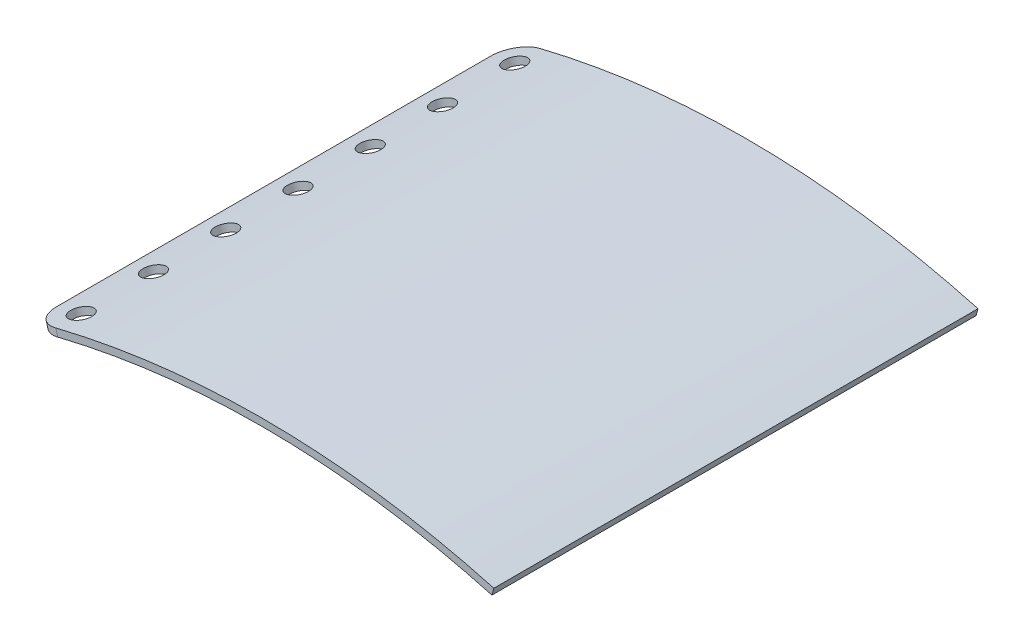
from build123d import *

# Parameters (mm, degrees)
EXTRU_MINCE1_DEPTH         = 67
R_P_TITION_LIN_AIRE1_COUNT = 7
R_P_TITION_LIN_AIRE1_PITCH = 10
CONG_1_R                   = 3.5


with BuildPart() as part:
    # Esquisse1 → Extru.-Mince1 (new body)
    with BuildSketch(Plane.XY):
        with BuildLine():
            ThreePointArc((0, 0), (32, 4.345341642), (64, 0))
            Line((64, 0), (63.733333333, -0.96378882))
            ThreePointArc((63.733333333, -0.96378882), (32, 3.345341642), (0.266666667, -0.96378882))
            Line((0.266666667, -0.96378882), (0, 0))
        make_face()
    extrude(amount=EXTRU_MINCE1_DEPTH)

    # Esquisse3 → Diam_tre du per_age _3.0 _3_2 (revolve, cut)
    with BuildSketch(Plane(origin=(3.386513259, 0.884040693, 3.5), x_dir=(-0.9711558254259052, -0.23844572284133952, 0), z_dir=(0, 0, 1))):
        Polygon((0, 0), (0, 110.121290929), (1.5, 109.22), (1.5, 0), align=None)
    diam_tre_du_per_age_3_0_3_2 = revolve(axis=Axis((1.872382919, 7.050880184, 3.5), (0.23844572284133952, -0.9711558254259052, 0)), mode=Mode.SUBTRACT)

    # R_p_tition lin_aire1: Diam_tre du per_age _3.0 _3_2 ×7
    with Locations(*[(0, 0, i * R_P_TITION_LIN_AIRE1_PITCH) for i in range(1, R_P_TITION_LIN_AIRE1_COUNT)]):
        add(diam_tre_du_per_age_3_0_3_2, mode=Mode.SUBTRACT)

    # Cong_1
    cong_1_edges = [part.edges().sort_by_distance(p)[0] for p in [
        (0.133333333, -0.48189441, 67),
        (0.133333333, -0.48189441, 0),
    ]]
    fillet(cong_1_edges, radius=CONG_1_R)


solid = part.part
